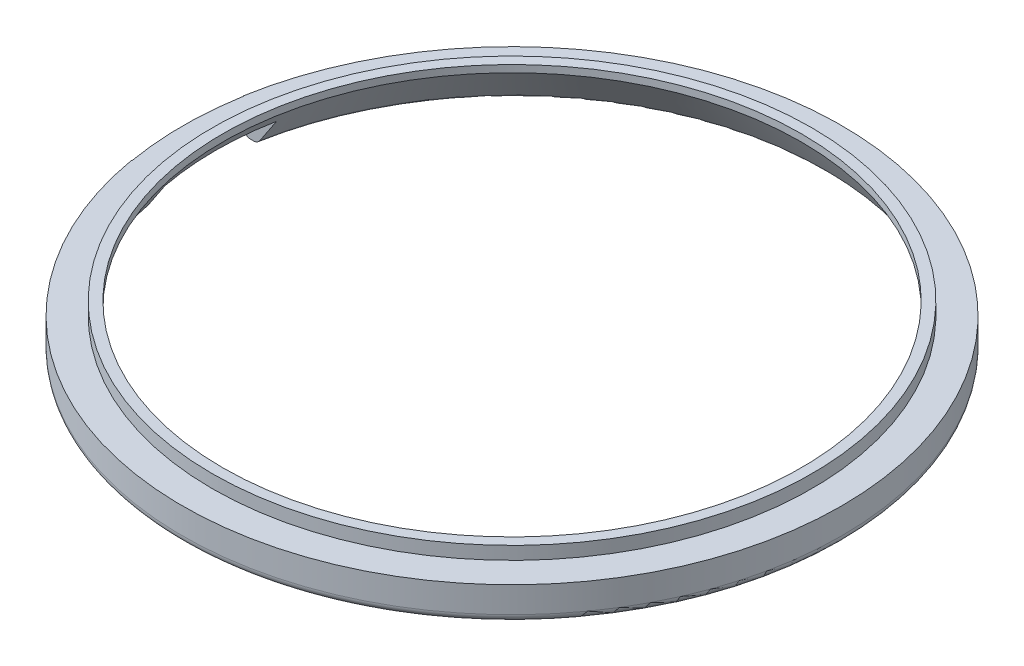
from build123d import *

# Parameters (mm, degrees)
SKETCH1_R           = 12.7
SKETCH1_R_2         = 11.15
BOSS_EXTRUDE1_DEPTH = 1.8
SKETCH2_W           = 4.3
SKETCH2_H           = 1.1
CUT_EXTRUDE1_DEPTH  = 19.050484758
FILLET2_R           = 0.3
SKETCH6_OUTSIDE_W   = 34.594
SKETCH6_OUTSIDE_H   = 34.594
SKETCH6_OUTSIDE_R   = 11.55
CUT_EXTRUDE4_DEPTH  = 0.5


with BuildPart() as part:
    # Sketch1 → Boss-Extrude1 (new body)
    with BuildSketch(Plane(origin=(0, 0, 0), x_dir=(1, 0, 0), z_dir=(0, 1, 0))):
        with Locations(Location((0, 0, 0), (0, 0, 270))):
            Circle(SKETCH1_R)
        with Locations(Location((0, 0, 0), (0, 0, 270))):
            Circle(SKETCH1_R_2, mode=Mode.SUBTRACT)
    extrude(amount=BOSS_EXTRUDE1_DEPTH)

    # Sketch2 → Cut-Extrude1 (cut, through all)
    with BuildSketch(Plane(origin=(0, 0, 0), x_dir=(0, 0, -1), z_dir=(1, 0, 0))):
        with Locations((0, 0.55)):
            Rectangle(SKETCH2_W, SKETCH2_H)
    extrude(amount=-CUT_EXTRUDE1_DEPTH, mode=Mode.SUBTRACT)

    # Sketch5 → Cut-Revolve1 (revolve, cut)
    with BuildSketch(Plane.XY, mode=Mode.PRIVATE) as cut_revolve1_sk:
        Polygon((12.15, 0), (11.15, 1.525253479), (11.15, 0), align=None)
    revolve(cut_revolve1_sk.sketch.rotate(Axis((0, 0, 0), (0, 1, 0)), 90), axis=Axis((0, 0, 0), (0, 1, 0)), mode=Mode.SUBTRACT)

    # Fillet2
    fillet2_edges = [part.edges().sort_by_distance(p)[0] for p in [
        (9.710689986, 0, -8.184894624),
        (9.32054183, 0, 7.794228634),
        (-12.7, 1.1, 0),
    ]]
    fillet(fillet2_edges, radius=FILLET2_R)

    # Sketch6 outside → Cut-Extrude4 (cut)
    with BuildSketch(Plane(origin=(0, 1.8, 0), x_dir=(1, 0, 0), z_dir=(0, 1, 0))):
        Rectangle(SKETCH6_OUTSIDE_W, SKETCH6_OUTSIDE_H)
        with Locations(Location((0, 0, 0), (0, 0, 270))):
            Circle(SKETCH6_OUTSIDE_R, mode=Mode.SUBTRACT)
    extrude(amount=-CUT_EXTRUDE4_DEPTH, mode=Mode.SUBTRACT)


solid = part.part
